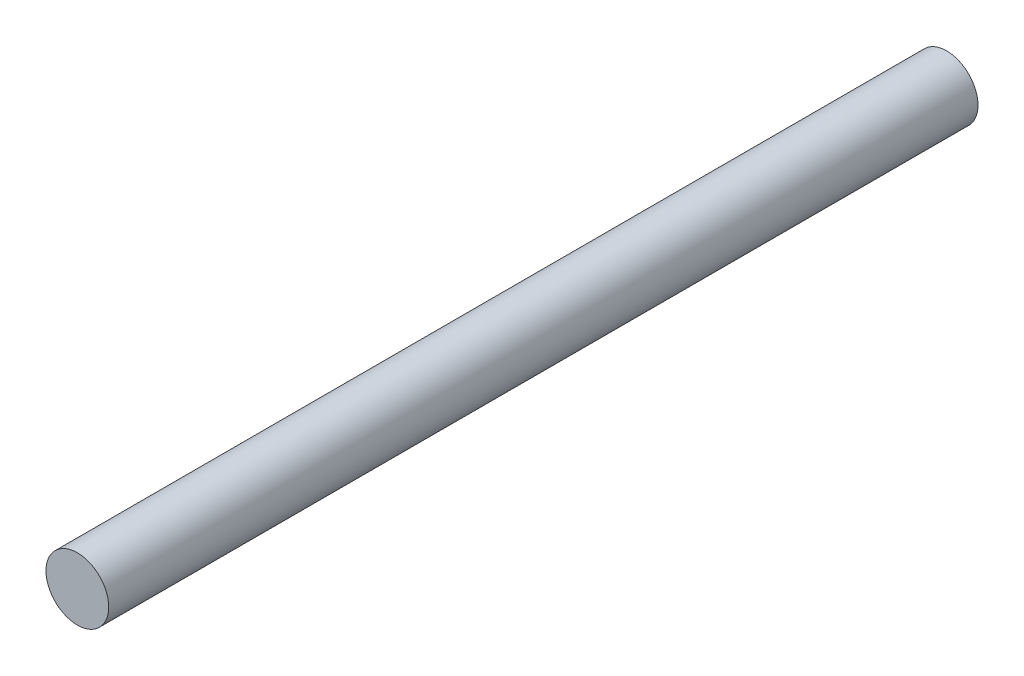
ISO-10303-21;
HEADER;
FILE_DESCRIPTION(('STEP AP214'),'2;1');
FILE_NAME('part.step','',(''),(''),'','','');
FILE_SCHEMA(('AUTOMOTIVE_DESIGN { 1 0 10303 214 1 1 1 1 }'));
ENDSEC;
DATA;
#1=APPLICATION_CONTEXT('core data for automotive mechanical design processes');
#2=APPLICATION_PROTOCOL_DEFINITION('international standard','automotive_design',2000,#1);
#3=PRODUCT_CONTEXT('',#1,'mechanical');
#4=PRODUCT('Part','Part','',(#3));
#5=PRODUCT_RELATED_PRODUCT_CATEGORY('part','',(#4));
#6=PRODUCT_DEFINITION_FORMATION('','',#4);
#7=PRODUCT_DEFINITION_CONTEXT('part definition',#1,'design');
#8=PRODUCT_DEFINITION('design','',#6,#7);
#9=PRODUCT_DEFINITION_SHAPE('','',#8);
#10=(LENGTH_UNIT() NAMED_UNIT(*) SI_UNIT(.MILLI.,.METRE.));
#11=(NAMED_UNIT(*) PLANE_ANGLE_UNIT() SI_UNIT($,.RADIAN.));
#12=(NAMED_UNIT(*) SI_UNIT($,.STERADIAN.) SOLID_ANGLE_UNIT());
#13=UNCERTAINTY_MEASURE_WITH_UNIT(LENGTH_MEASURE(1.E-05),#10,'distance_accuracy_value','');
#14=(GEOMETRIC_REPRESENTATION_CONTEXT(3) GLOBAL_UNCERTAINTY_ASSIGNED_CONTEXT((#13)) GLOBAL_UNIT_ASSIGNED_CONTEXT((#10,
#11,#12)) REPRESENTATION_CONTEXT('',''));
#15=CARTESIAN_POINT('',(0.,0.,0.));
#16=DIRECTION('',(0.,0.,1.));
#17=DIRECTION('',(1.,0.,0.));
#18=AXIS2_PLACEMENT_3D('',#15,#16,#17);
#19=CARTESIAN_POINT('',(0.,0.,30.5034251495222));
#20=DIRECTION('',(0.,0.,1.));
#21=DIRECTION('',(1.,0.,0.));
#22=AXIS2_PLACEMENT_3D('',#19,#20,#21);
#23=PLANE('',#22);
#24=CARTESIAN_POINT('',(0.,0.,30.5034251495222));
#25=DIRECTION('',(0.,0.,-1.));
#26=DIRECTION('',(-1.,0.,0.));
#27=AXIS2_PLACEMENT_3D('',#24,#25,#26);
#28=CIRCLE('',#27,2.2);
#29=CARTESIAN_POINT('',(-2.2,0.,30.5034251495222));
#30=VERTEX_POINT('',#29);
#31=EDGE_CURVE('E10',#30,#30,#28,.T.);
#32=ORIENTED_EDGE('',*,*,#31,.F.);
#33=EDGE_LOOP('',(#32));
#34=FACE_BOUND('',#33,.T.);
#35=ADVANCED_FACE('F15',(#34),#23,.T.);
#36=CARTESIAN_POINT('',(0.,0.,-30.5034251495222));
#37=DIRECTION('',(0.,0.,-1.));
#38=DIRECTION('',(-1.,0.,0.));
#39=AXIS2_PLACEMENT_3D('',#36,#37,#38);
#40=PLANE('',#39);
#41=CARTESIAN_POINT('',(0.,0.,-30.5034251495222));
#42=DIRECTION('',(0.,0.,1.));
#43=DIRECTION('',(1.,0.,0.));
#44=AXIS2_PLACEMENT_3D('',#41,#42,#43);
#45=CIRCLE('',#44,2.2);
#46=CARTESIAN_POINT('',(2.2,0.,-30.5034251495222));
#47=VERTEX_POINT('',#46);
#48=EDGE_CURVE('E22',#47,#47,#45,.T.);
#49=ORIENTED_EDGE('',*,*,#48,.F.);
#50=EDGE_LOOP('',(#49));
#51=FACE_BOUND('',#50,.T.);
#52=ADVANCED_FACE('F26',(#51),#40,.T.);
#53=CARTESIAN_POINT('',(0.,0.,-30.5034251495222));
#54=DIRECTION('',(0.,0.,1.));
#55=DIRECTION('',(1.,0.,0.));
#56=AXIS2_PLACEMENT_3D('',#53,#54,#55);
#57=CYLINDRICAL_SURFACE('',#56,2.2);
#58=ORIENTED_EDGE('',*,*,#31,.T.);
#59=EDGE_LOOP('',(#58));
#60=FACE_BOUND('',#59,.T.);
#61=ORIENTED_EDGE('',*,*,#48,.T.);
#62=EDGE_LOOP('',(#61));
#63=FACE_BOUND('',#62,.T.);
#64=ADVANCED_FACE('F17',(#60,#63),#57,.T.);
#65=CLOSED_SHELL('',(#35,#52,#64));
#66=MANIFOLD_SOLID_BREP('B1',#65);
#67=ADVANCED_BREP_SHAPE_REPRESENTATION('',(#18,#66),#14);
#68=SHAPE_DEFINITION_REPRESENTATION(#9,#67);
ENDSEC;
END-ISO-10303-21;
